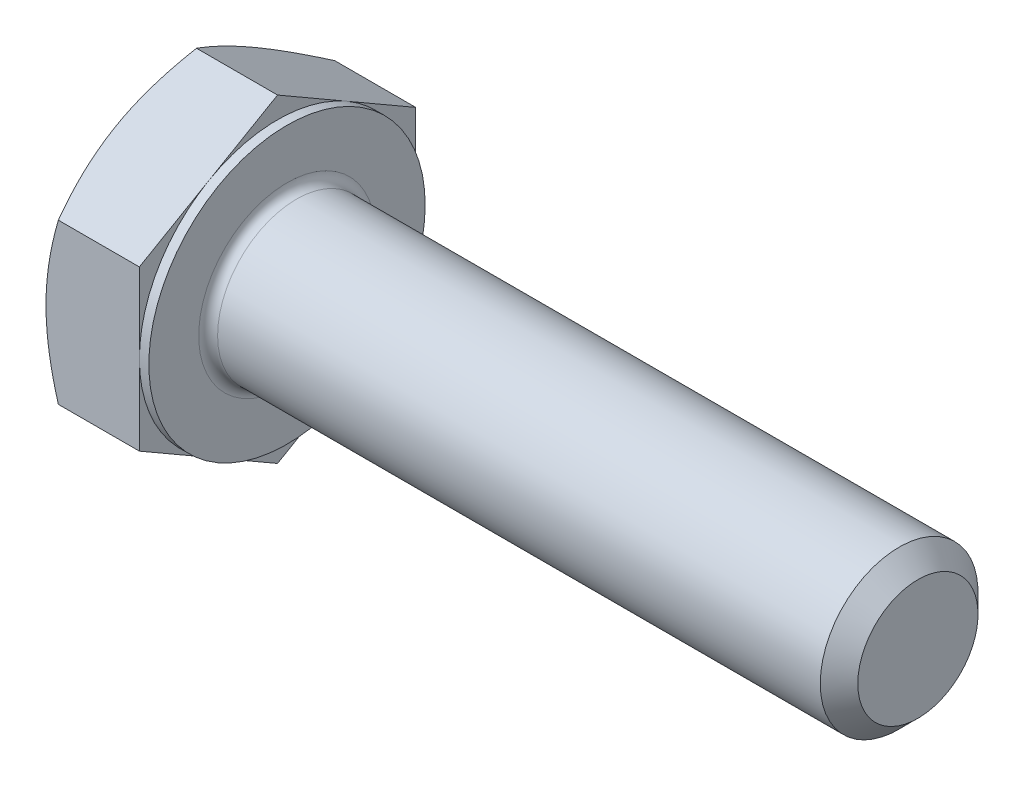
from build123d import *

# Parameters (mm, degrees)
BASEHEAD_DEPTH = 4.1402
SKETCH4_W      = 0.381
SKETCH4_H      = 26.260537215
HEADFILLET_R   = 0.381


with BuildPart() as part:
    # Sketch1 → BaseHead (new body)
    with BuildSketch(Plane(origin=(0, 0, 0), x_dir=(0, 0, -1), z_dir=(1, 0, 0))):
        Polygon((5.5626, 3.211568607), (5.5626, -3.211568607), (0, -6.423137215), (-5.5626, -3.211568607), (-5.5626, 3.211568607), (0, 6.423137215), align=None)
    extrude(amount=BASEHEAD_DEPTH)

    # BodySke → BaseBody (revolve)
    with BuildSketch(Plane.XY, mode=Mode.PRIVATE) as basebody_sk:
        Polygon((0, 0), (29.5402, 0), (29.5402, 2.41935), (28.78455, 3.175), (0, 3.175), align=None)
    revolve(basebody_sk.sketch.rotate(Axis((0, 0, 0), (1, 0, 0)), 90), axis=Axis((0, 0, 0), (1, 0, 0)))

    # Sketch3 → HeadChamfer (revolve, cut)
    with BuildSketch(Plane.XY):
        Polygon((0, 5.5626), (4.163005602, 12.773137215), (4.163005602, 19.123137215), (-12.7, 19.123137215), (-12.7, 5.5626), align=None)
    revolve(axis=Axis((0, 0, 0), (1, 0, 0)), mode=Mode.SUBTRACT)

    # Sketch4 → BearingFace (revolve, cut)
    with BuildSketch(Plane.XY, mode=Mode.PRIVATE) as bearingface_sk:
        with Locations((3.9497, 18.692868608)):
            Rectangle(SKETCH4_W, SKETCH4_H)
    revolve(bearingface_sk.sketch.rotate(Axis((0, 0, 0), (1, 0, 0)), 270), axis=Axis((0, 0, 0), (1, 0, 0)), mode=Mode.SUBTRACT)

    # HeadFillet
    headfillet_edges = [part.edges().sort_by_distance(p)[0] for p in [
        (4.1402, 0, -3.175),
    ]]
    fillet(headfillet_edges, radius=HEADFILLET_R)


solid = part.part
